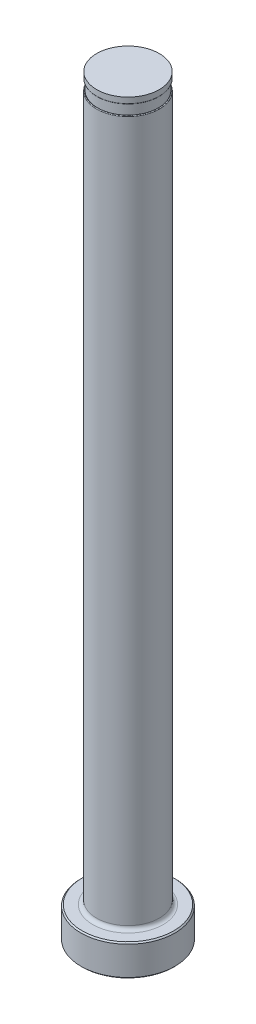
from build123d import *

# Parameters (mm, degrees)
CHAMFER1_SIZE     = 0.254
FILLET1_R         = 0.762
SKETCH2_W         = 0.2032
SKETCH2_H         = 2.032
D_SLOT_DEPTH      = 153.9941543
D_SLOT_DEPTH_BACK = 153.9941543
SKETCH5_W         = 0.0127
SKETCH5_H         = 1.27
FILLET2_R         = 0.127


with BuildPart() as part:
    # Sketch1 → Revolve1 (revolve)
    with BuildSketch(Plane.XY, mode=Mode.PRIVATE) as revolve1_sk:
        Polygon((0, 0), (-9.525, 0), (-9.525, 6.35), (-6.35, 6.35), (-6.35, 152.4), (0, 152.4), align=None)
    revolve(revolve1_sk.sketch.rotate(Axis((0, 259.958771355, 0), (0, -1, 0)), 270), axis=Axis((0, 259.958771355, 0), (0, -1, 0)))

    # Chamfer1
    chamfer1_edges = [part.edges().sort_by_distance(p)[0] for p in [
        (0, 6.35, -9.525),
        (0, 0, -9.525),
    ]]
    chamfer(chamfer1_edges, length=CHAMFER1_SIZE)

    # Fillet1
    fillet1_edges = [part.edges().sort_by_distance(p)[0] for p in [
        (0, 6.35, -6.35),
    ]]
    fillet(fillet1_edges, radius=FILLET1_R)

    # Sketch2 → Vent Relief (revolve, cut)
    with BuildSketch(Plane.XY, mode=Mode.PRIVATE) as vent_relief_sk:
        with Locations((-6.2484, 150.114)):
            Rectangle(SKETCH2_W, SKETCH2_H)
    revolve(vent_relief_sk.sketch.rotate(Axis((0, 153.448281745, 0), (0, -1, 0)), 270), axis=Axis((0, 153.448281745, 0), (0, -1, 0)), mode=Mode.SUBTRACT)

    # Sketch3 → D-Slot (cut, two sides: drawn at the far end of the back side and taken through both)
    with BuildSketch(Plane.XY.offset(-D_SLOT_DEPTH_BACK)):
        with BuildLine():
            Line((-6.1468, 150.114), (-6.1468, 86.614))
            ThreePointArc((-6.1468, 86.614), (-6.198013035, 86.046038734), (-6.35, 85.4964))
            Line((-6.35, 85.4964), (-6.35, 150.114))
            Line((-6.35, 150.114), (-6.1468, 150.114))
        make_face()
    extrude(amount=D_SLOT_DEPTH + D_SLOT_DEPTH_BACK, mode=Mode.SUBTRACT)

    # Sketch5 → Vent Diameter (revolve, cut)
    with BuildSketch(Plane.XY, mode=Mode.PRIVATE) as vent_diameter_sk:
        with Locations((-6.34365, 151.765)):
            Rectangle(SKETCH5_W, SKETCH5_H)
    revolve(vent_diameter_sk.sketch.rotate(Axis((0, 152.687735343, 0), (0, -1, 0)), 90), axis=Axis((0, 152.687735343, 0), (0, -1, 0)), mode=Mode.SUBTRACT)

    # Fillet2
    fillet2_edges = [part.edges().sort_by_distance(p)[0] for p in [
        (5.022023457, 149.098, -3.886100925),
        (0, 151.13, 6.3373),
    ]]
    fillet(fillet2_edges, radius=FILLET2_R)


solid = part.part
